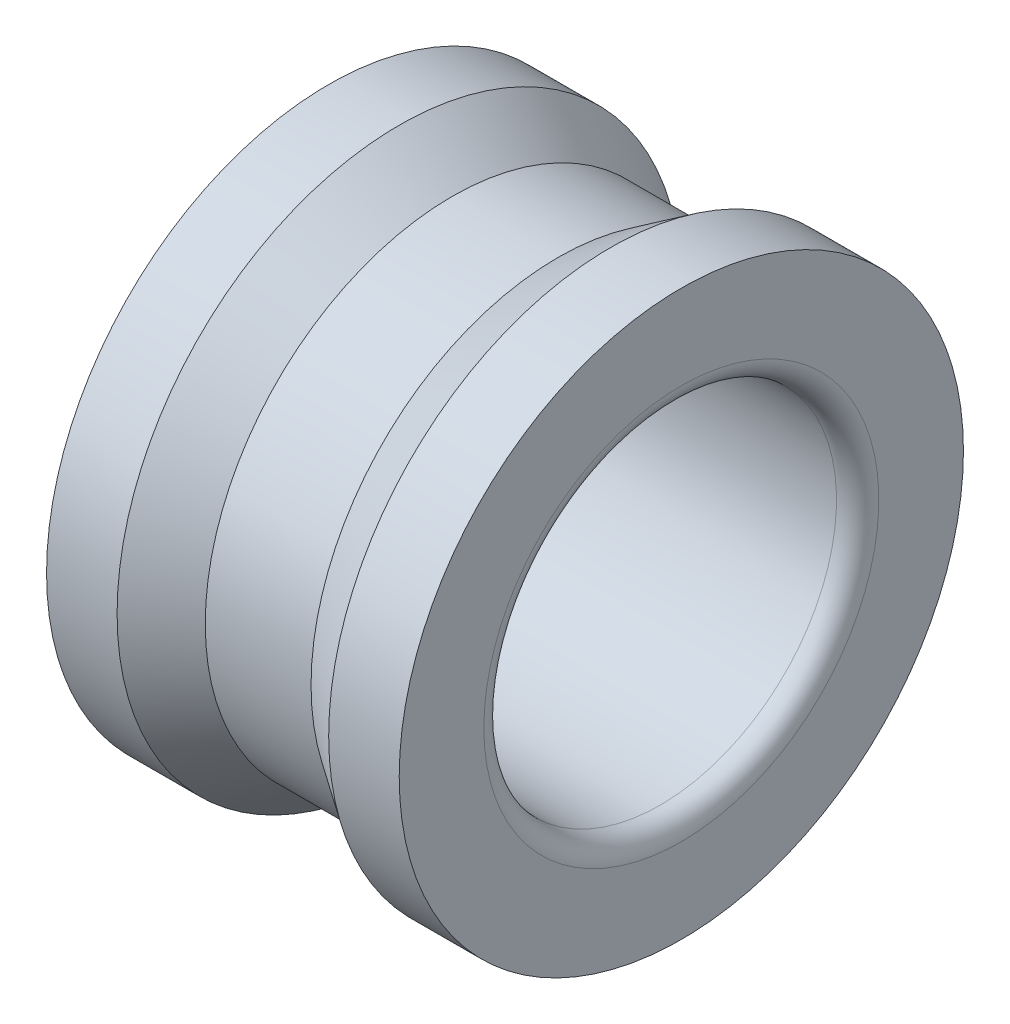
from build123d import *

# Parameters (mm, degrees)
FILLET1_R = 0.3


with BuildPart() as part:
    # Sketch2 → Revolve1 (revolve)
    with BuildSketch(Plane.XY, mode=Mode.PRIVATE) as revolve1_sk:
        Polygon((-2.5, 2.5), (2.5, 2.5), (2.5, 4), (1.5, 4), (0.75, 3.5), (-0.75, 3.5), (-1.5, 4), (-2.5, 4), align=None)
    revolve(revolve1_sk.sketch.rotate(Axis((-2.5, 0, 0), (1, 0, 0)), 90), axis=Axis((-2.5, 0, 0), (1, 0, 0)))

    # Fillet1
    fillet1_edges = [part.edges().sort_by_distance(p)[0] for p in [
        (2.5, 0, -2.5),
        (-2.5, 0, -2.5),
    ]]
    fillet(fillet1_edges, radius=FILLET1_R)


solid = part.part
